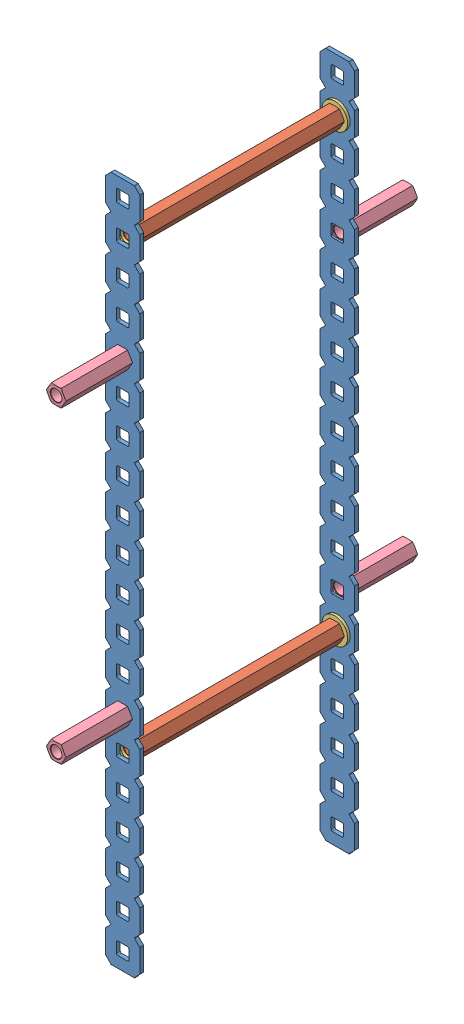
SolidWorks assembly Class Project Middle child.SLDASM, configuration Default (file format 10000). Lengths in mm.
Overall size (12.7 254.09 131.18).
12 component instances, 4 part files, 16 mates.
Components (placement in the parent):
- Bar 10inch-2: Bar 10inch.SLDPRT [Default] at (-12.7 -131.0386 -1.4224) x (1 0 0) z (0 -1 0) size (12.7 1.42 254.09)
- Bar 10inch-3: Bar 10inch.SLDPRT [Default] at (-12.7 -131.0386 -80.9244) x (1 0 0) z (0 -1 0) size (12.7 1.42 254.09)
- Stand-Off 3in-1: Stand-Off 3in.SLDPRT [Default] at (-6.35 167.4114 -40.4622) x (1 0 0) z (0 -1 0) size (7.34 77.08 7.34)
- Washer Delrin-1: Washer Delrin.SLDPRT [Default] at (-6.35 167.4114 -2.3622) x (1 0 0) z (0 -1 0) size (9.53 0.94 9.53)
- Washer Delrin-2: Washer Delrin.SLDPRT [Default] at (-6.35 167.4114 -79.502) x (1 0 0) z (0 -1 0) size (9.53 0.94 9.53)
- Stand-Off 3in-3: Stand-Off 3in.SLDPRT [Default] at (-6.35 2.3114 -40.4622) x (1 0 0) z (0 -1 0) size (7.34 77.08 7.34)
- Washer Delrin-5: Washer Delrin.SLDPRT [Default] at (-6.35 2.3114 -2.3622) x (1 0 0) z (0 -1 0) size (9.53 0.94 9.53)
- Washer Delrin-6: Washer Delrin.SLDPRT [Default] at (-6.35 2.3114 -79.502) x (1 0 0) z (0 -1 0) size (9.53 0.94 9.53)
- Stand-Off 1in-1: Stand-Off 1in.SLDPRT [Default] at (-6.35 15.0114 11.95) x (1 0 0) z (0 1 0) size (7.34 26.28 7.34)
- Stand-Off 1in-3: Stand-Off 1in.SLDPRT [Default] at (-6.35 15.0114 -92.95) x (1 0 0) z (0 1 0) size (7.34 26.28 7.34)
- Stand-Off 1in-4: Stand-Off 1in.SLDPRT [Default] at (-6.35 129.3014 11.95) x (1 0 0) z (0 1 0) size (7.34 26.28 7.34)
- Stand-Off 1in-5: Stand-Off 1in.SLDPRT [Default] at (-6.35 129.3014 -92.95) x (1 0 0) z (0 1 0) size (7.34 26.28 7.34)
Mates (geometry in assembly coordinates):
- Coincident18: coincident aligned: plane of Bar 10inch-2 through (0 57.4344 0) normal (1 0 0); plane of Bar 10inch-3 through (0 44.7344 -79.502) normal (1 0 0)
- Coincident19: coincident aligned: plane of Bar 10inch-2 through (-10.668 186.4614 0) normal (0 1 0); plane of Bar 10inch-3 through (-10.668 186.4614 -79.502) normal (0 1 0)
- Coincident24: coincident aligned: plane of Bar 10inch-2 through (-1.8474 161.0614 0) normal (0 0 1); plane of assembly through (0 0 0) normal (0 0 1)
- Coincident25: coincident aligned: plane of Bar 10inch-2 through (0 -6.0656 0) normal (1 0 0); plane of assembly through (0 0 0) normal (1 0 0)
- Coincident26: coincident aligned: plane of Bar 10inch-2 through (-8.1534 0 0) normal (0 1 0); plane of assembly through (0 0 0) normal (0 1 0)
- Coincident28: coincident anti-aligned: plane of Bar 10inch-2 through (-1.8474 161.0614 -1.4224) normal (0 0 -1); plane of Washer Delrin-1 through (-1.5875 167.4114 -1.4224) normal (0 0 1)
- Width1: width: plane of Bar 10inch-2 through (-8.6614 169.2148 0) normal (1 0 0); plane of Bar 10inch-2 through (-4.0386 165.608 0) normal (-1 0 0); cylinder of Washer Delrin-1 through (-6.35 167.4114 -1.4224) axis (0 0 -1) radius 2.1971
- Width2: width: plane of Bar 10inch-2 through (-8.1534 165.1 0) normal (0 1 0); plane of Bar 10inch-2 through (-4.5466 169.7228 0) normal (0 -1 0); cylinder of Washer Delrin-1 through (-6.35 167.4114 -1.4224) axis (0 0 -1) radius 2.1971
- Concentric1: concentric anti-aligned: cylinder of Stand-Off 3in-1 through (-6.35 167.4114 -2.3622) axis (0 0 1) radius 2.0955; cylinder of Washer Delrin-1 through (-6.35 167.4114 -1.4224) axis (0 0 -1) radius 2.1971
- Coincident29: coincident anti-aligned: plane of Stand-Off 3in-1 through (-8.1831 170.5864 -2.3622) normal (0 0 1); plane of Washer Delrin-1 through (-4.1529 167.4114 -2.3622) normal (0 0 -1)
- Concentric2: concentric aligned: cylinder of Stand-Off 3in-1 through (-6.35 167.4114 -78.5622) axis (0 0 -1) radius 2.0955; cylinder of Washer Delrin-2 through (-6.35 167.4114 -78.5622) axis (0 0 -1) radius 2.1971
- Coincident30: coincident anti-aligned: plane of Bar 10inch-3 through (-1.8474 161.0614 -79.502) normal (0 0 1); plane of Washer Delrin-2 through (-4.1529 167.4114 -79.502) normal (0 0 -1)
- Width3: width anti-aligned: plane of Stand-Off 1in-1 through (-4.5169 18.1864 -0.75) normal (0.866025 0.5 0); plane of Stand-Off 1in-1 through (-10.0162 15.0114 -0.75) normal (-0.866025 0.5 0); plane of Bar 10inch-2 through (-8.6614 16.8148 0) normal (1 0 0); plane of Bar 10inch-2 through (-4.0386 13.208 0) normal (-1 0 0)
- Width4: width anti-aligned: plane of Stand-Off 1in-1 through (-8.1831 18.1864 -0.75) normal (0 1 0); plane of Stand-Off 1in-1 through (-4.5169 11.8364 -0.75) normal (0 -1 0); plane of Bar 10inch-2 through (-4.5466 17.3228 0) normal (0 -1 0); plane of Bar 10inch-2 through (-8.1534 12.7 0) normal (0 1 0)
- Distance1: distance = 0.75 mm anti-aligned: plane of Stand-Off 1in-1 through (-8.1831 11.8364 -0.75) normal (0 0 -1); plane of Bar 10inch-2 through (-1.8474 161.0614 0) normal (0 0 1)
- Coincident36: coincident aligned: circle of Stand-Off 3in-3; plane of Washer Delrin-6 through (-1.5875 2.3114 -78.5622) normal (0 0 1)
